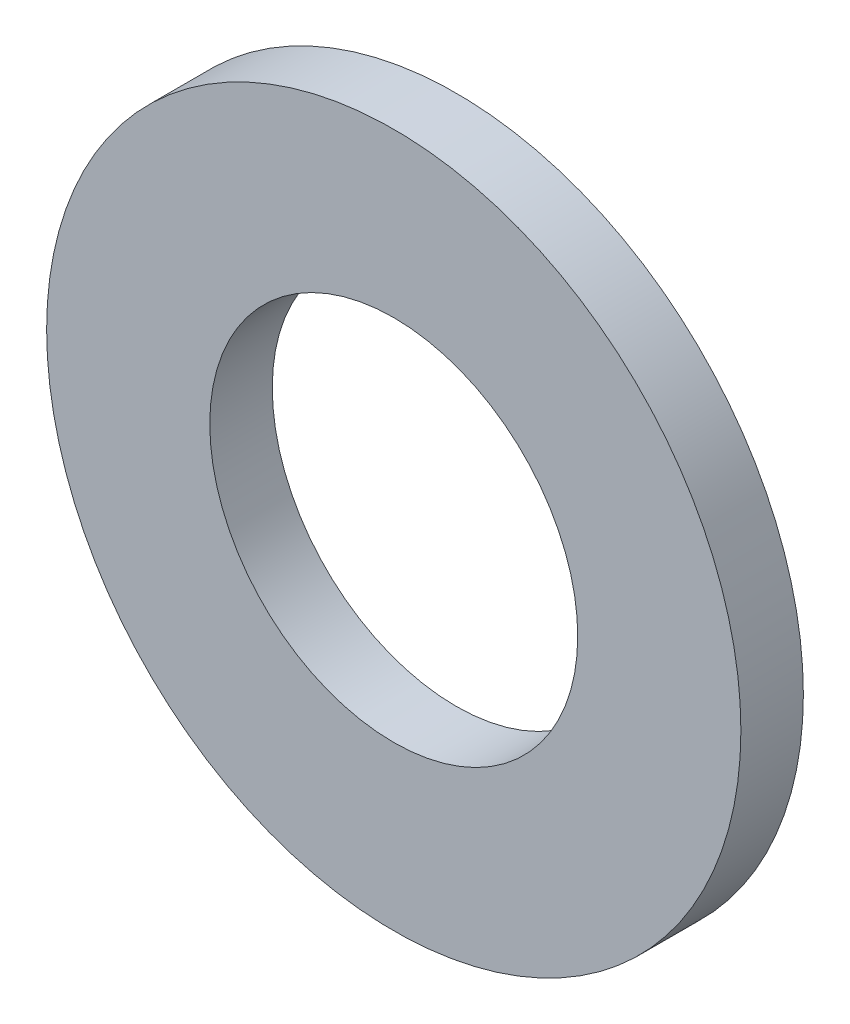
from build123d import *

# Parameters (mm, degrees)
SKETCH1_R      = 5
SKETCH1_R_2    = 2.65
EXTRUDE1_DEPTH = 0.9


with BuildPart() as part:
    # Sketch1 → Extrude1 (new body)
    with BuildSketch(Plane.XY):
        Circle(SKETCH1_R)
        Circle(SKETCH1_R_2, mode=Mode.SUBTRACT)
    extrude(amount=-EXTRUDE1_DEPTH)


solid = part.part
